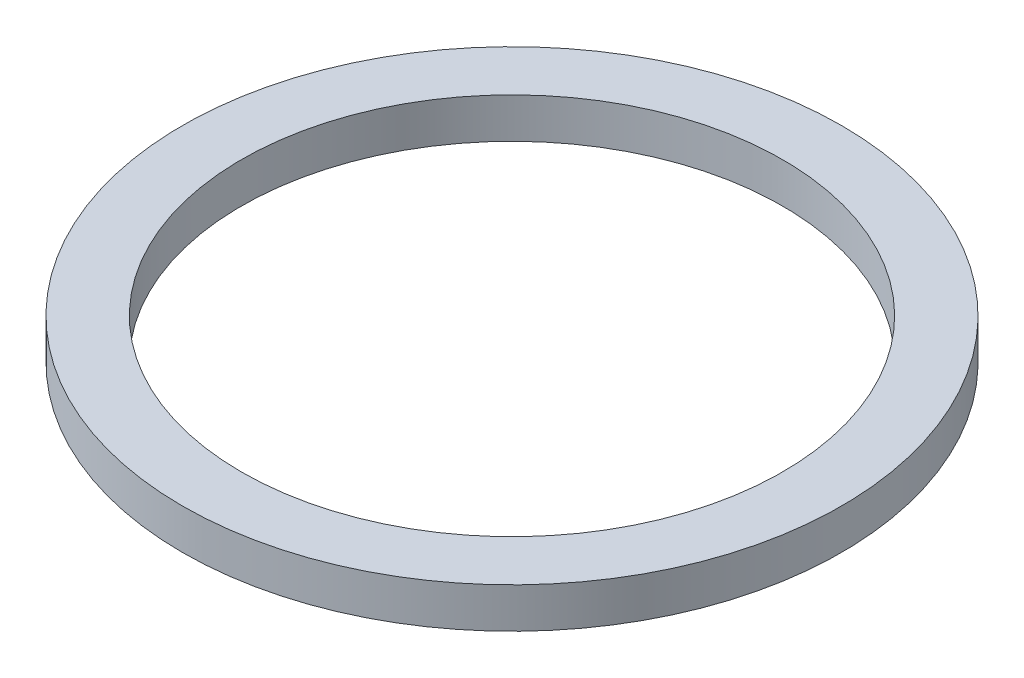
ISO-10303-21;
HEADER;
FILE_DESCRIPTION(('STEP AP214'),'2;1');
FILE_NAME('part.step','',(''),(''),'','','');
FILE_SCHEMA(('AUTOMOTIVE_DESIGN { 1 0 10303 214 1 1 1 1 }'));
ENDSEC;
DATA;
#1=APPLICATION_CONTEXT('core data for automotive mechanical design processes');
#2=APPLICATION_PROTOCOL_DEFINITION('international standard','automotive_design',2000,#1);
#3=PRODUCT_CONTEXT('',#1,'mechanical');
#4=PRODUCT('Part','Part','',(#3));
#5=PRODUCT_RELATED_PRODUCT_CATEGORY('part','',(#4));
#6=PRODUCT_DEFINITION_FORMATION('','',#4);
#7=PRODUCT_DEFINITION_CONTEXT('part definition',#1,'design');
#8=PRODUCT_DEFINITION('design','',#6,#7);
#9=PRODUCT_DEFINITION_SHAPE('','',#8);
#10=(LENGTH_UNIT() NAMED_UNIT(*) SI_UNIT(.MILLI.,.METRE.));
#11=(NAMED_UNIT(*) PLANE_ANGLE_UNIT() SI_UNIT($,.RADIAN.));
#12=(NAMED_UNIT(*) SI_UNIT($,.STERADIAN.) SOLID_ANGLE_UNIT());
#13=UNCERTAINTY_MEASURE_WITH_UNIT(LENGTH_MEASURE(1.E-05),#10,'distance_accuracy_value','');
#14=(GEOMETRIC_REPRESENTATION_CONTEXT(3) GLOBAL_UNCERTAINTY_ASSIGNED_CONTEXT((#13)) GLOBAL_UNIT_ASSIGNED_CONTEXT((#10,
#11,#12)) REPRESENTATION_CONTEXT('',''));
#15=CARTESIAN_POINT('',(0.,0.,0.));
#16=DIRECTION('',(0.,0.,1.));
#17=DIRECTION('',(1.,0.,0.));
#18=AXIS2_PLACEMENT_3D('',#15,#16,#17);
#19=CARTESIAN_POINT('',(0.,1.4732,0.));
#20=DIRECTION('',(0.,-1.,0.));
#21=DIRECTION('',(0.,0.,-1.));
#22=AXIS2_PLACEMENT_3D('',#19,#20,#21);
#23=CYLINDRICAL_SURFACE('',#22,12.065);
#24=CARTESIAN_POINT('',(0.,1.4732,0.));
#25=DIRECTION('',(0.,1.,0.));
#26=DIRECTION('',(0.,0.,1.));
#27=AXIS2_PLACEMENT_3D('',#24,#25,#26);
#28=CIRCLE('',#27,12.065);
#29=CARTESIAN_POINT('',(0.,1.4732,12.065));
#30=VERTEX_POINT('',#29);
#31=EDGE_CURVE('E10',#30,#30,#28,.T.);
#32=ORIENTED_EDGE('',*,*,#31,.F.);
#33=EDGE_LOOP('',(#32));
#34=FACE_BOUND('',#33,.T.);
#35=CARTESIAN_POINT('',(0.,0.,0.));
#36=DIRECTION('',(0.,1.,0.));
#37=DIRECTION('',(0.,0.,1.));
#38=AXIS2_PLACEMENT_3D('',#35,#36,#37);
#39=CIRCLE('',#38,12.065);
#40=CARTESIAN_POINT('',(0.,0.,12.065));
#41=VERTEX_POINT('',#40);
#42=EDGE_CURVE('E40',#41,#41,#39,.T.);
#43=ORIENTED_EDGE('',*,*,#42,.T.);
#44=EDGE_LOOP('',(#43));
#45=FACE_BOUND('',#44,.T.);
#46=ADVANCED_FACE('F34',(#34,#45),#23,.T.);
#47=CARTESIAN_POINT('',(0.,1.4732,0.));
#48=DIRECTION('',(0.,1.,0.));
#49=DIRECTION('',(0.,0.,1.));
#50=AXIS2_PLACEMENT_3D('',#47,#48,#49);
#51=PLANE('',#50);
#52=CARTESIAN_POINT('',(0.,1.4732,0.));
#53=DIRECTION('',(0.,1.,0.));
#54=DIRECTION('',(0.,0.,1.));
#55=AXIS2_PLACEMENT_3D('',#52,#53,#54);
#56=CIRCLE('',#55,9.906);
#57=CARTESIAN_POINT('',(0.,1.4732,9.906));
#58=VERTEX_POINT('',#57);
#59=EDGE_CURVE('E48',#58,#58,#56,.T.);
#60=ORIENTED_EDGE('',*,*,#59,.F.);
#61=EDGE_LOOP('',(#60));
#62=FACE_BOUND('',#61,.T.);
#63=ORIENTED_EDGE('',*,*,#31,.T.);
#64=EDGE_LOOP('',(#63));
#65=FACE_BOUND('',#64,.T.);
#66=ADVANCED_FACE('F56',(#62,#65),#51,.T.);
#67=CARTESIAN_POINT('',(0.,0.,0.));
#68=DIRECTION('',(0.,1.,0.));
#69=DIRECTION('',(0.,0.,1.));
#70=AXIS2_PLACEMENT_3D('',#67,#68,#69);
#71=PLANE('',#70);
#72=CARTESIAN_POINT('',(0.,0.,0.));
#73=DIRECTION('',(0.,1.,0.));
#74=DIRECTION('',(0.,0.,1.));
#75=AXIS2_PLACEMENT_3D('',#72,#73,#74);
#76=CIRCLE('',#75,9.906);
#77=CARTESIAN_POINT('',(0.,0.,9.906));
#78=VERTEX_POINT('',#77);
#79=EDGE_CURVE('E44',#78,#78,#76,.T.);
#80=ORIENTED_EDGE('',*,*,#79,.T.);
#81=EDGE_LOOP('',(#80));
#82=FACE_BOUND('',#81,.T.);
#83=ORIENTED_EDGE('',*,*,#42,.F.);
#84=EDGE_LOOP('',(#83));
#85=FACE_BOUND('',#84,.T.);
#86=ADVANCED_FACE('F58',(#82,#85),#71,.F.);
#87=CARTESIAN_POINT('',(0.,0.,0.));
#88=DIRECTION('',(0.,1.,0.));
#89=DIRECTION('',(0.,0.,1.));
#90=AXIS2_PLACEMENT_3D('',#87,#88,#89);
#91=CYLINDRICAL_SURFACE('',#90,9.906);
#92=ORIENTED_EDGE('',*,*,#79,.F.);
#93=EDGE_LOOP('',(#92));
#94=FACE_BOUND('',#93,.T.);
#95=ORIENTED_EDGE('',*,*,#59,.T.);
#96=EDGE_LOOP('',(#95));
#97=FACE_BOUND('',#96,.T.);
#98=ADVANCED_FACE('F54',(#94,#97),#91,.F.);
#99=CLOSED_SHELL('',(#46,#66,#86,#98));
#100=MANIFOLD_SOLID_BREP('B2',#99);
#101=ADVANCED_BREP_SHAPE_REPRESENTATION('',(#18,#100),#14);
#102=SHAPE_DEFINITION_REPRESENTATION(#9,#101);
ENDSEC;
END-ISO-10303-21;
